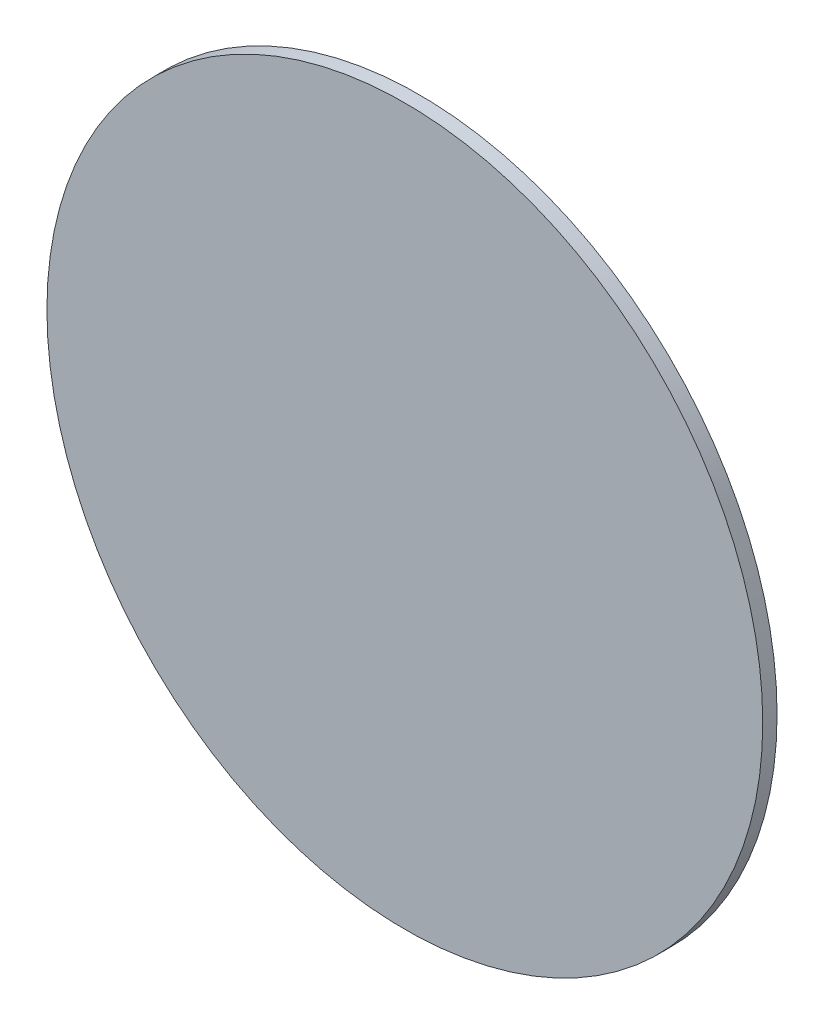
from build123d import *

# Parameters (mm, degrees)
SKETCH1_R      = 12.5
EXTRUDE1_DEPTH = 0.5


with BuildPart() as part:
    # Sketch1 → Extrude1 (new body)
    with BuildSketch(Plane.XY):
        Circle(SKETCH1_R)
    extrude(amount=EXTRUDE1_DEPTH)


solid = part.part
